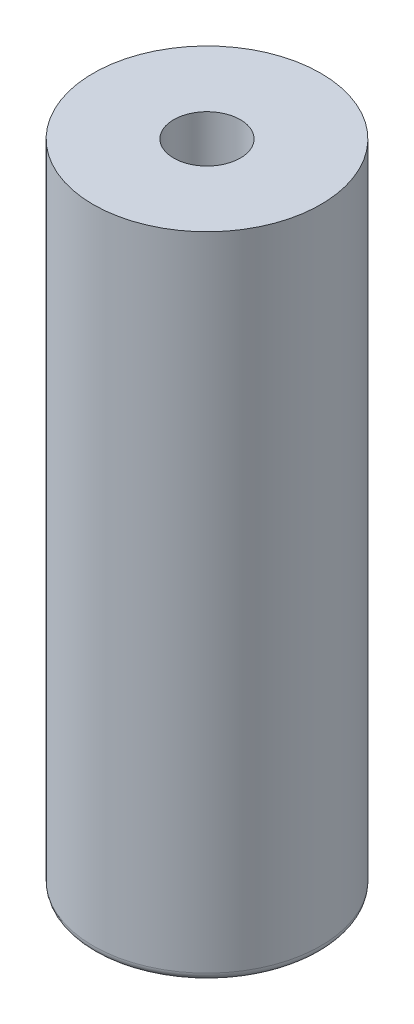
ISO-10303-21;
HEADER;
FILE_DESCRIPTION(('STEP AP214'),'2;1');
FILE_NAME('part.step','',(''),(''),'','','');
FILE_SCHEMA(('AUTOMOTIVE_DESIGN { 1 0 10303 214 1 1 1 1 }'));
ENDSEC;
DATA;
#1=APPLICATION_CONTEXT('core data for automotive mechanical design processes');
#2=APPLICATION_PROTOCOL_DEFINITION('international standard','automotive_design',2000,#1);
#3=PRODUCT_CONTEXT('',#1,'mechanical');
#4=PRODUCT('Part','Part','',(#3));
#5=PRODUCT_RELATED_PRODUCT_CATEGORY('part','',(#4));
#6=PRODUCT_DEFINITION_FORMATION('','',#4);
#7=PRODUCT_DEFINITION_CONTEXT('part definition',#1,'design');
#8=PRODUCT_DEFINITION('design','',#6,#7);
#9=PRODUCT_DEFINITION_SHAPE('','',#8);
#10=(LENGTH_UNIT() NAMED_UNIT(*) SI_UNIT(.MILLI.,.METRE.));
#11=(NAMED_UNIT(*) PLANE_ANGLE_UNIT() SI_UNIT($,.RADIAN.));
#12=(NAMED_UNIT(*) SI_UNIT($,.STERADIAN.) SOLID_ANGLE_UNIT());
#13=UNCERTAINTY_MEASURE_WITH_UNIT(LENGTH_MEASURE(1.E-05),#10,'distance_accuracy_value','');
#14=(GEOMETRIC_REPRESENTATION_CONTEXT(3) GLOBAL_UNCERTAINTY_ASSIGNED_CONTEXT((#13)) GLOBAL_UNIT_ASSIGNED_CONTEXT((#10,
#11,#12)) REPRESENTATION_CONTEXT('',''));
#15=CARTESIAN_POINT('',(0.,0.,0.));
#16=DIRECTION('',(0.,0.,1.));
#17=DIRECTION('',(1.,0.,0.));
#18=AXIS2_PLACEMENT_3D('',#15,#16,#17);
#19=CARTESIAN_POINT('',(0.,0.,0.));
#20=DIRECTION('',(0.,-1.,0.));
#21=DIRECTION('',(0.,0.,-1.));
#22=AXIS2_PLACEMENT_3D('',#19,#20,#21);
#23=CYLINDRICAL_SURFACE('',#22,7.);
#24=CARTESIAN_POINT('',(0.,-39.5,0.));
#25=DIRECTION('',(0.,1.,0.));
#26=DIRECTION('',(0.,0.,1.));
#27=AXIS2_PLACEMENT_3D('',#24,#25,#26);
#28=CIRCLE('',#27,7.);
#29=CARTESIAN_POINT('',(0.,-39.5,7.));
#30=VERTEX_POINT('',#29);
#31=EDGE_CURVE('E10',#30,#30,#28,.T.);
#32=ORIENTED_EDGE('',*,*,#31,.T.);
#33=EDGE_LOOP('',(#32));
#34=FACE_BOUND('',#33,.T.);
#35=CARTESIAN_POINT('',(0.,0.,0.));
#36=DIRECTION('',(0.,-1.,0.));
#37=DIRECTION('',(0.,0.,-1.));
#38=AXIS2_PLACEMENT_3D('',#35,#36,#37);
#39=CIRCLE('',#38,7.);
#40=CARTESIAN_POINT('',(0.,0.,-7.));
#41=VERTEX_POINT('',#40);
#42=EDGE_CURVE('E69',#41,#41,#39,.T.);
#43=ORIENTED_EDGE('',*,*,#42,.T.);
#44=EDGE_LOOP('',(#43));
#45=FACE_BOUND('',#44,.T.);
#46=ADVANCED_FACE('F43',(#34,#45),#23,.T.);
#47=CARTESIAN_POINT('',(-7.,0.,0.));
#48=DIRECTION('',(0.,-1.,0.));
#49=DIRECTION('',(0.,0.,-1.));
#50=AXIS2_PLACEMENT_3D('',#47,#48,#49);
#51=PLANE('',#50);
#52=ORIENTED_EDGE('',*,*,#42,.F.);
#53=EDGE_LOOP('',(#52));
#54=FACE_BOUND('',#53,.T.);
#55=CARTESIAN_POINT('',(0.,0.,0.));
#56=DIRECTION('',(0.,-1.,0.));
#57=DIRECTION('',(0.,0.,-1.));
#58=AXIS2_PLACEMENT_3D('',#55,#56,#57);
#59=CIRCLE('',#58,2.05);
#60=CARTESIAN_POINT('',(0.,0.,-2.05));
#61=VERTEX_POINT('',#60);
#62=EDGE_CURVE('E72',#61,#61,#59,.T.);
#63=ORIENTED_EDGE('',*,*,#62,.T.);
#64=EDGE_LOOP('',(#63));
#65=FACE_BOUND('',#64,.T.);
#66=ADVANCED_FACE('F100',(#54,#65),#51,.F.);
#67=CARTESIAN_POINT('',(0.,0.,0.));
#68=DIRECTION('',(0.,-1.,0.));
#69=DIRECTION('',(0.,0.,-1.));
#70=AXIS2_PLACEMENT_3D('',#67,#68,#69);
#71=CYLINDRICAL_SURFACE('',#70,2.05);
#72=ORIENTED_EDGE('',*,*,#62,.F.);
#73=EDGE_LOOP('',(#72));
#74=FACE_BOUND('',#73,.T.);
#75=CARTESIAN_POINT('',(0.,-4.,0.));
#76=DIRECTION('',(0.,-1.,0.));
#77=DIRECTION('',(0.,0.,-1.));
#78=AXIS2_PLACEMENT_3D('',#75,#76,#77);
#79=CIRCLE('',#78,2.05);
#80=CARTESIAN_POINT('',(0.,-4.,-2.05));
#81=VERTEX_POINT('',#80);
#82=EDGE_CURVE('E76',#81,#81,#79,.T.);
#83=ORIENTED_EDGE('',*,*,#82,.T.);
#84=EDGE_LOOP('',(#83));
#85=FACE_BOUND('',#84,.T.);
#86=ADVANCED_FACE('F96',(#74,#85),#71,.F.);
#87=CARTESIAN_POINT('',(-2.05,-4.,0.));
#88=DIRECTION('',(0.,1.,0.));
#89=DIRECTION('',(0.,0.,1.));
#90=AXIS2_PLACEMENT_3D('',#87,#88,#89);
#91=PLANE('',#90);
#92=ORIENTED_EDGE('',*,*,#82,.F.);
#93=EDGE_LOOP('',(#92));
#94=FACE_BOUND('',#93,.T.);
#95=CARTESIAN_POINT('',(0.,-4.,0.));
#96=DIRECTION('',(0.,-1.,0.));
#97=DIRECTION('',(0.,0.,-1.));
#98=AXIS2_PLACEMENT_3D('',#95,#96,#97);
#99=CIRCLE('',#98,3.8);
#100=CARTESIAN_POINT('',(0.,-4.,-3.8));
#101=VERTEX_POINT('',#100);
#102=EDGE_CURVE('E79',#101,#101,#99,.T.);
#103=ORIENTED_EDGE('',*,*,#102,.T.);
#104=EDGE_LOOP('',(#103));
#105=FACE_BOUND('',#104,.T.);
#106=ADVANCED_FACE('F84',(#94,#105),#91,.F.);
#107=CARTESIAN_POINT('',(0.,0.,0.));
#108=DIRECTION('',(0.,-1.,0.));
#109=DIRECTION('',(0.,0.,-1.));
#110=AXIS2_PLACEMENT_3D('',#107,#108,#109);
#111=CYLINDRICAL_SURFACE('',#110,3.8);
#112=CARTESIAN_POINT('',(0.,-39.5,0.));
#113=DIRECTION('',(0.,1.,0.));
#114=DIRECTION('',(0.,0.,1.));
#115=AXIS2_PLACEMENT_3D('',#112,#113,#114);
#116=CIRCLE('',#115,3.8);
#117=CARTESIAN_POINT('',(0.,-39.5,3.8));
#118=VERTEX_POINT('',#117);
#119=EDGE_CURVE('E63',#118,#118,#116,.F.);
#120=ORIENTED_EDGE('',*,*,#119,.T.);
#121=EDGE_LOOP('',(#120));
#122=FACE_BOUND('',#121,.T.);
#123=ORIENTED_EDGE('',*,*,#102,.F.);
#124=EDGE_LOOP('',(#123));
#125=FACE_BOUND('',#124,.T.);
#126=ADVANCED_FACE('F86',(#122,#125),#111,.F.);
#127=CARTESIAN_POINT('',(-3.8,-40.,0.));
#128=DIRECTION('',(0.,1.,0.));
#129=DIRECTION('',(0.,0.,1.));
#130=AXIS2_PLACEMENT_3D('',#127,#128,#129);
#131=PLANE('',#130);
#132=CARTESIAN_POINT('',(0.,-40.,0.));
#133=DIRECTION('',(0.,1.,0.));
#134=DIRECTION('',(0.,0.,1.));
#135=AXIS2_PLACEMENT_3D('',#132,#133,#134);
#136=CIRCLE('',#135,4.3);
#137=CARTESIAN_POINT('',(0.,-40.,4.3));
#138=VERTEX_POINT('',#137);
#139=EDGE_CURVE('E51',#138,#138,#136,.T.);
#140=ORIENTED_EDGE('',*,*,#139,.T.);
#141=EDGE_LOOP('',(#140));
#142=FACE_BOUND('',#141,.T.);
#143=CARTESIAN_POINT('',(0.,-40.,0.));
#144=DIRECTION('',(0.,1.,0.));
#145=DIRECTION('',(0.,0.,1.));
#146=AXIS2_PLACEMENT_3D('',#143,#144,#145);
#147=CIRCLE('',#146,6.5);
#148=CARTESIAN_POINT('',(0.,-40.,6.5));
#149=VERTEX_POINT('',#148);
#150=EDGE_CURVE('E58',#149,#149,#147,.F.);
#151=ORIENTED_EDGE('',*,*,#150,.T.);
#152=EDGE_LOOP('',(#151));
#153=FACE_BOUND('',#152,.T.);
#154=ADVANCED_FACE('F88',(#142,#153),#131,.F.);
#155=CARTESIAN_POINT('',(0.,-39.5,0.));
#156=DIRECTION('',(0.,1.,0.));
#157=DIRECTION('',(0.,0.,1.));
#158=AXIS2_PLACEMENT_3D('',#155,#156,#157);
#159=TOROIDAL_SURFACE('',#158,4.3,0.5);
#160=ORIENTED_EDGE('',*,*,#139,.F.);
#161=EDGE_LOOP('',(#160));
#162=FACE_BOUND('',#161,.T.);
#163=ORIENTED_EDGE('',*,*,#119,.F.);
#164=EDGE_LOOP('',(#163));
#165=FACE_BOUND('',#164,.T.);
#166=ADVANCED_FACE('F94',(#162,#165),#159,.T.);
#167=CARTESIAN_POINT('',(0.,-39.5,0.));
#168=DIRECTION('',(0.,1.,0.));
#169=DIRECTION('',(0.,0.,1.));
#170=AXIS2_PLACEMENT_3D('',#167,#168,#169);
#171=TOROIDAL_SURFACE('',#170,6.5,0.5);
#172=ORIENTED_EDGE('',*,*,#31,.F.);
#173=EDGE_LOOP('',(#172));
#174=FACE_BOUND('',#173,.T.);
#175=ORIENTED_EDGE('',*,*,#150,.F.);
#176=EDGE_LOOP('',(#175));
#177=FACE_BOUND('',#176,.T.);
#178=ADVANCED_FACE('F45',(#174,#177),#171,.T.);
#179=CLOSED_SHELL('',(#46,#66,#86,#106,#126,#154,#166,#178));
#180=MANIFOLD_SOLID_BREP('B2',#179);
#181=ADVANCED_BREP_SHAPE_REPRESENTATION('',(#18,#180),#14);
#182=SHAPE_DEFINITION_REPRESENTATION(#9,#181);
ENDSEC;
END-ISO-10303-21;
